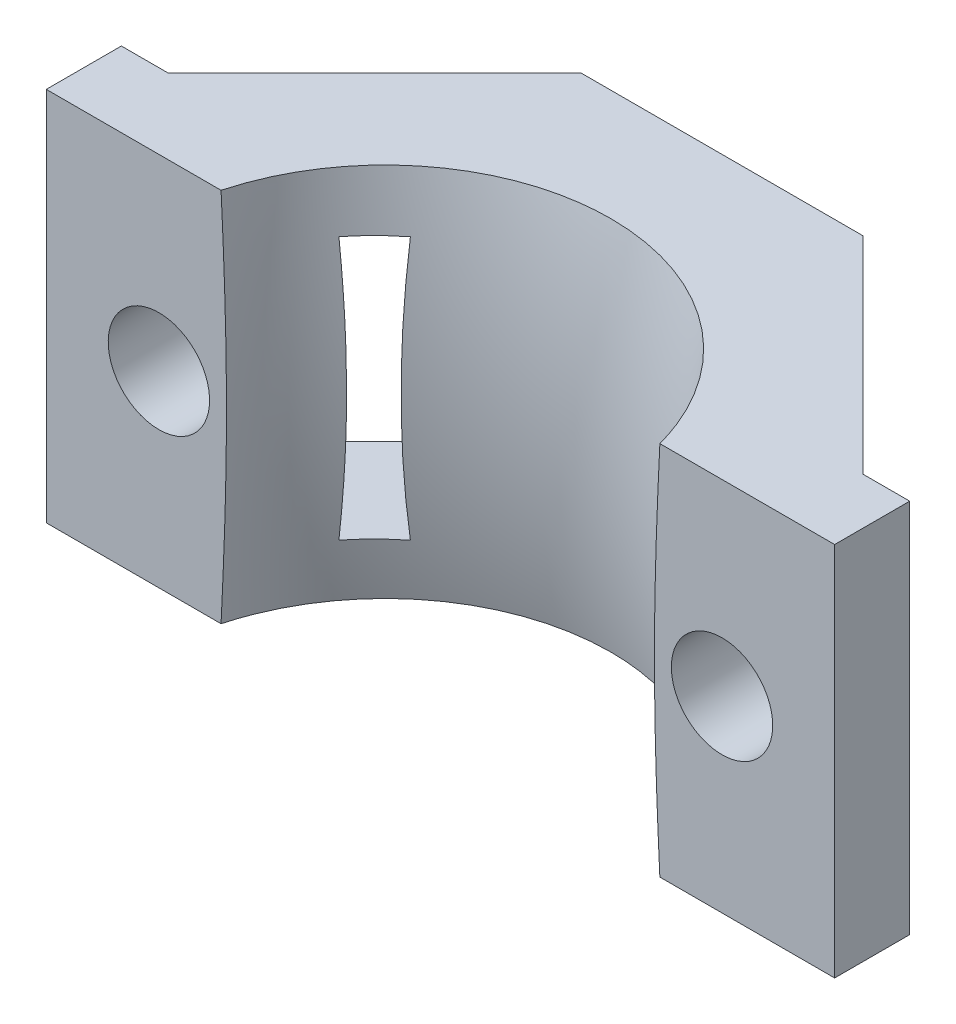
ISO-10303-21;
HEADER;
FILE_DESCRIPTION(('STEP AP214'),'2;1');
FILE_NAME('part.step','',(''),(''),'','','');
FILE_SCHEMA(('AUTOMOTIVE_DESIGN { 1 0 10303 214 1 1 1 1 }'));
ENDSEC;
DATA;
#1=APPLICATION_CONTEXT('core data for automotive mechanical design processes');
#2=APPLICATION_PROTOCOL_DEFINITION('international standard','automotive_design',2000,#1);
#3=PRODUCT_CONTEXT('',#1,'mechanical');
#4=PRODUCT('Part','Part','',(#3));
#5=PRODUCT_RELATED_PRODUCT_CATEGORY('part','',(#4));
#6=PRODUCT_DEFINITION_FORMATION('','',#4);
#7=PRODUCT_DEFINITION_CONTEXT('part definition',#1,'design');
#8=PRODUCT_DEFINITION('design','',#6,#7);
#9=PRODUCT_DEFINITION_SHAPE('','',#8);
#10=(LENGTH_UNIT() NAMED_UNIT(*) SI_UNIT(.MILLI.,.METRE.));
#11=(NAMED_UNIT(*) PLANE_ANGLE_UNIT() SI_UNIT($,.RADIAN.));
#12=(NAMED_UNIT(*) SI_UNIT($,.STERADIAN.) SOLID_ANGLE_UNIT());
#13=UNCERTAINTY_MEASURE_WITH_UNIT(LENGTH_MEASURE(1.E-05),#10,'distance_accuracy_value','');
#14=(GEOMETRIC_REPRESENTATION_CONTEXT(3) GLOBAL_UNCERTAINTY_ASSIGNED_CONTEXT((#13)) GLOBAL_UNIT_ASSIGNED_CONTEXT((#10,
#11,#12)) REPRESENTATION_CONTEXT('',''));
#15=CARTESIAN_POINT('',(0.,0.,0.));
#16=DIRECTION('',(0.,0.,1.));
#17=DIRECTION('',(1.,0.,0.));
#18=AXIS2_PLACEMENT_3D('',#15,#16,#17);
#19=CARTESIAN_POINT('',(15.,22.5,-82.));
#20=DIRECTION('',(0.,0.,1.));
#21=DIRECTION('',(1.,0.,0.));
#22=AXIS2_PLACEMENT_3D('',#19,#20,#21);
#23=CYLINDRICAL_SURFACE('',#22,2.7);
#24=CARTESIAN_POINT('',(15.,22.5,-82.));
#25=DIRECTION('',(0.,0.,1.));
#26=DIRECTION('',(1.,0.,0.));
#27=AXIS2_PLACEMENT_3D('',#24,#25,#26);
#28=CIRCLE('',#27,2.7);
#29=CARTESIAN_POINT('',(15.,25.2,-82.));
#30=VERTEX_POINT('',#29);
#31=EDGE_CURVE('E19',#30,#30,#28,.T.);
#32=ORIENTED_EDGE('',*,*,#31,.F.);
#33=EDGE_LOOP('',(#32));
#34=FACE_BOUND('',#33,.T.);
#35=CARTESIAN_POINT('',(15.,22.5,-78.));
#36=DIRECTION('',(0.,0.,1.));
#37=DIRECTION('',(1.,0.,0.));
#38=AXIS2_PLACEMENT_3D('',#35,#36,#37);
#39=CIRCLE('',#38,2.7);
#40=CARTESIAN_POINT('',(15.,25.2,-78.));
#41=VERTEX_POINT('',#40);
#42=EDGE_CURVE('E34',#41,#41,#39,.F.);
#43=ORIENTED_EDGE('',*,*,#42,.F.);
#44=EDGE_LOOP('',(#43));
#45=FACE_BOUND('',#44,.T.);
#46=ADVANCED_FACE('F16',(#34,#45),#23,.F.);
#47=CARTESIAN_POINT('',(18.5,32.5,-82.));
#48=DIRECTION('',(0.707106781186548,0.,-0.707106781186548));
#49=DIRECTION('',(-0.707106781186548,0.,-0.707106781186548));
#50=AXIS2_PLACEMENT_3D('',#47,#48,#49);
#51=PLANE('',#50);
#52=DIRECTION('',(0.707106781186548,0.,0.707106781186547));
#53=VECTOR('',#52,1.);
#54=CARTESIAN_POINT('',(7.5,12.5,-93.));
#55=LINE('',#54,#53);
#56=CARTESIAN_POINT('',(7.5,12.5,-93.));
#57=VERTEX_POINT('',#56);
#58=CARTESIAN_POINT('',(18.5,12.5,-82.));
#59=VERTEX_POINT('',#58);
#60=EDGE_CURVE('E292',#57,#59,#55,.T.);
#61=ORIENTED_EDGE('',*,*,#60,.F.);
#62=DIRECTION('',(0.,1.,0.));
#63=VECTOR('',#62,1.);
#64=CARTESIAN_POINT('',(7.5,32.5,-93.));
#65=LINE('',#64,#63);
#66=CARTESIAN_POINT('',(7.5,15.5,-93.));
#67=VERTEX_POINT('',#66);
#68=EDGE_CURVE('E192',#67,#57,#65,.F.);
#69=ORIENTED_EDGE('',*,*,#68,.F.);
#70=DIRECTION('',(-0.707106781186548,0.,-0.707106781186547));
#71=VECTOR('',#70,1.);
#72=CARTESIAN_POINT('',(18.5,15.5,-82.));
#73=LINE('',#72,#71);
#74=CARTESIAN_POINT('',(18.5,15.5,-82.));
#75=VERTEX_POINT('',#74);
#76=EDGE_CURVE('E315',#75,#67,#73,.T.);
#77=ORIENTED_EDGE('',*,*,#76,.F.);
#78=DIRECTION('',(0.,1.,0.));
#79=VECTOR('',#78,1.);
#80=CARTESIAN_POINT('',(18.5,32.5,-82.));
#81=LINE('',#80,#79);
#82=EDGE_CURVE('E262',#59,#75,#81,.T.);
#83=ORIENTED_EDGE('',*,*,#82,.F.);
#84=EDGE_LOOP('',(#61,#69,#77,#83));
#85=FACE_BOUND('',#84,.T.);
#86=ADVANCED_FACE('F537',(#85),#51,.T.);
#87=CARTESIAN_POINT('',(18.5,32.5,-82.));
#88=DIRECTION('',(0.707106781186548,0.,-0.707106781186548));
#89=DIRECTION('',(-0.707106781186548,0.,-0.707106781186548));
#90=AXIS2_PLACEMENT_3D('',#87,#88,#89);
#91=PLANE('',#90);
#92=DIRECTION('',(0.707106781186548,0.,0.707106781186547));
#93=VECTOR('',#92,1.);
#94=CARTESIAN_POINT('',(7.5,32.5,-93.));
#95=LINE('',#94,#93);
#96=CARTESIAN_POINT('',(7.5,32.5,-93.));
#97=VERTEX_POINT('',#96);
#98=CARTESIAN_POINT('',(18.5,32.5,-82.));
#99=VERTEX_POINT('',#98);
#100=EDGE_CURVE('E257',#97,#99,#95,.T.);
#101=ORIENTED_EDGE('',*,*,#100,.T.);
#102=DIRECTION('',(0.,1.,0.));
#103=VECTOR('',#102,1.);
#104=CARTESIAN_POINT('',(18.5,32.5,-82.));
#105=LINE('',#104,#103);
#106=CARTESIAN_POINT('',(18.5,29.5,-82.));
#107=VERTEX_POINT('',#106);
#108=EDGE_CURVE('E191',#107,#99,#105,.T.);
#109=ORIENTED_EDGE('',*,*,#108,.F.);
#110=DIRECTION('',(0.707106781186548,0.,0.707106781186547));
#111=VECTOR('',#110,1.);
#112=CARTESIAN_POINT('',(7.5,29.5,-93.));
#113=LINE('',#112,#111);
#114=CARTESIAN_POINT('',(7.5,29.5,-93.));
#115=VERTEX_POINT('',#114);
#116=EDGE_CURVE('E321',#115,#107,#113,.T.);
#117=ORIENTED_EDGE('',*,*,#116,.F.);
#118=DIRECTION('',(0.,1.,0.));
#119=VECTOR('',#118,1.);
#120=CARTESIAN_POINT('',(7.5,32.5,-93.));
#121=LINE('',#120,#119);
#122=EDGE_CURVE('E204',#97,#115,#121,.F.);
#123=ORIENTED_EDGE('',*,*,#122,.F.);
#124=EDGE_LOOP('',(#101,#109,#117,#123));
#125=FACE_BOUND('',#124,.T.);
#126=ADVANCED_FACE('F549',(#125),#91,.T.);
#127=CARTESIAN_POINT('',(21.,32.5,-78.));
#128=DIRECTION('',(1.,0.,0.));
#129=DIRECTION('',(0.,0.,-1.));
#130=AXIS2_PLACEMENT_3D('',#127,#128,#129);
#131=PLANE('',#130);
#132=DIRECTION('',(0.,0.,-1.));
#133=VECTOR('',#132,1.);
#134=CARTESIAN_POINT('',(21.,32.5,-83.5044583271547));
#135=LINE('',#134,#133);
#136=CARTESIAN_POINT('',(21.,32.5,-82.));
#137=VERTEX_POINT('',#136);
#138=CARTESIAN_POINT('',(21.,32.5,-78.));
#139=VERTEX_POINT('',#138);
#140=EDGE_CURVE('E249',#137,#139,#135,.F.);
#141=ORIENTED_EDGE('',*,*,#140,.T.);
#142=DIRECTION('',(0.,1.,0.));
#143=VECTOR('',#142,1.);
#144=CARTESIAN_POINT('',(21.,32.5,-78.));
#145=LINE('',#144,#143);
#146=CARTESIAN_POINT('',(21.,12.5,-78.));
#147=VERTEX_POINT('',#146);
#148=EDGE_CURVE('E244',#147,#139,#145,.T.);
#149=ORIENTED_EDGE('',*,*,#148,.F.);
#150=DIRECTION('',(0.,0.,-1.));
#151=VECTOR('',#150,1.);
#152=CARTESIAN_POINT('',(21.,12.5,-83.5044583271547));
#153=LINE('',#152,#151);
#154=CARTESIAN_POINT('',(21.,12.5,-82.));
#155=VERTEX_POINT('',#154);
#156=EDGE_CURVE('E285',#155,#147,#153,.F.);
#157=ORIENTED_EDGE('',*,*,#156,.F.);
#158=DIRECTION('',(0.,1.,0.));
#159=VECTOR('',#158,1.);
#160=CARTESIAN_POINT('',(21.,32.5,-82.));
#161=LINE('',#160,#159);
#162=EDGE_CURVE('E260',#137,#155,#161,.F.);
#163=ORIENTED_EDGE('',*,*,#162,.F.);
#164=EDGE_LOOP('',(#141,#149,#157,#163));
#165=FACE_BOUND('',#164,.T.);
#166=ADVANCED_FACE('F544',(#165),#131,.T.);
#167=CARTESIAN_POINT('',(-21.,32.5,-82.));
#168=DIRECTION('',(-1.,0.,0.));
#169=DIRECTION('',(0.,0.,1.));
#170=AXIS2_PLACEMENT_3D('',#167,#168,#169);
#171=PLANE('',#170);
#172=DIRECTION('',(0.,0.,-1.));
#173=VECTOR('',#172,1.);
#174=CARTESIAN_POINT('',(-21.,32.5,-83.5044583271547));
#175=LINE('',#174,#173);
#176=CARTESIAN_POINT('',(-21.,32.5,-78.));
#177=VERTEX_POINT('',#176);
#178=CARTESIAN_POINT('',(-21.,32.5,-82.));
#179=VERTEX_POINT('',#178);
#180=EDGE_CURVE('E220',#177,#179,#175,.T.);
#181=ORIENTED_EDGE('',*,*,#180,.T.);
#182=DIRECTION('',(0.,1.,0.));
#183=VECTOR('',#182,1.);
#184=CARTESIAN_POINT('',(-21.,32.5,-82.));
#185=LINE('',#184,#183);
#186=CARTESIAN_POINT('',(-21.,12.5,-82.));
#187=VERTEX_POINT('',#186);
#188=EDGE_CURVE('E214',#187,#179,#185,.T.);
#189=ORIENTED_EDGE('',*,*,#188,.F.);
#190=DIRECTION('',(0.,0.,-1.));
#191=VECTOR('',#190,1.);
#192=CARTESIAN_POINT('',(-21.,12.5,-83.5044583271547));
#193=LINE('',#192,#191);
#194=CARTESIAN_POINT('',(-21.,12.5,-78.));
#195=VERTEX_POINT('',#194);
#196=EDGE_CURVE('E235',#195,#187,#193,.T.);
#197=ORIENTED_EDGE('',*,*,#196,.F.);
#198=DIRECTION('',(0.,1.,0.));
#199=VECTOR('',#198,1.);
#200=CARTESIAN_POINT('',(-21.,32.5,-78.));
#201=LINE('',#200,#199);
#202=EDGE_CURVE('E279',#177,#195,#201,.F.);
#203=ORIENTED_EDGE('',*,*,#202,.F.);
#204=EDGE_LOOP('',(#181,#189,#197,#203));
#205=FACE_BOUND('',#204,.T.);
#206=ADVANCED_FACE('F526',(#205),#171,.T.);
#207=CARTESIAN_POINT('',(-15.,22.5,-82.));
#208=DIRECTION('',(0.,0.,1.));
#209=DIRECTION('',(1.,0.,0.));
#210=AXIS2_PLACEMENT_3D('',#207,#208,#209);
#211=CYLINDRICAL_SURFACE('',#210,2.7);
#212=CARTESIAN_POINT('',(-15.,22.5,-82.));
#213=DIRECTION('',(0.,0.,1.));
#214=DIRECTION('',(1.,0.,0.));
#215=AXIS2_PLACEMENT_3D('',#212,#213,#214);
#216=CIRCLE('',#215,2.7);
#217=CARTESIAN_POINT('',(-15.,19.8,-82.));
#218=VERTEX_POINT('',#217);
#219=EDGE_CURVE('E168',#218,#218,#216,.T.);
#220=ORIENTED_EDGE('',*,*,#219,.F.);
#221=EDGE_LOOP('',(#220));
#222=FACE_BOUND('',#221,.T.);
#223=CARTESIAN_POINT('',(-15.,22.5,-78.));
#224=DIRECTION('',(0.,0.,1.));
#225=DIRECTION('',(1.,0.,0.));
#226=AXIS2_PLACEMENT_3D('',#223,#224,#225);
#227=CIRCLE('',#226,2.7);
#228=CARTESIAN_POINT('',(-15.,19.8,-78.));
#229=VERTEX_POINT('',#228);
#230=EDGE_CURVE('E433',#229,#229,#227,.F.);
#231=ORIENTED_EDGE('',*,*,#230,.F.);
#232=EDGE_LOOP('',(#231));
#233=FACE_BOUND('',#232,.T.);
#234=ADVANCED_FACE('F566',(#222,#233),#211,.F.);
#235=CARTESIAN_POINT('',(-7.5,32.5,-93.));
#236=DIRECTION('',(-0.707106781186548,0.,-0.707106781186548));
#237=DIRECTION('',(-0.707106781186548,0.,0.707106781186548));
#238=AXIS2_PLACEMENT_3D('',#235,#236,#237);
#239=PLANE('',#238);
#240=DIRECTION('',(0.707106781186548,0.,-0.707106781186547));
#241=VECTOR('',#240,1.);
#242=CARTESIAN_POINT('',(-18.5,12.5,-82.));
#243=LINE('',#242,#241);
#244=CARTESIAN_POINT('',(-18.5,12.5,-82.));
#245=VERTEX_POINT('',#244);
#246=CARTESIAN_POINT('',(-7.5,12.5,-93.));
#247=VERTEX_POINT('',#246);
#248=EDGE_CURVE('E237',#245,#247,#243,.T.);
#249=ORIENTED_EDGE('',*,*,#248,.F.);
#250=DIRECTION('',(0.,1.,0.));
#251=VECTOR('',#250,1.);
#252=CARTESIAN_POINT('',(-18.5,32.5,-82.));
#253=LINE('',#252,#251);
#254=CARTESIAN_POINT('',(-18.5,15.5,-82.));
#255=VERTEX_POINT('',#254);
#256=EDGE_CURVE('E207',#255,#245,#253,.F.);
#257=ORIENTED_EDGE('',*,*,#256,.F.);
#258=DIRECTION('',(-0.707106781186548,0.,0.707106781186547));
#259=VECTOR('',#258,1.);
#260=CARTESIAN_POINT('',(-7.5,15.5,-93.));
#261=LINE('',#260,#259);
#262=CARTESIAN_POINT('',(-7.5,15.5,-93.));
#263=VERTEX_POINT('',#262);
#264=EDGE_CURVE('E197',#263,#255,#261,.T.);
#265=ORIENTED_EDGE('',*,*,#264,.F.);
#266=DIRECTION('',(0.,1.,0.));
#267=VECTOR('',#266,1.);
#268=CARTESIAN_POINT('',(-7.5,32.5,-93.));
#269=LINE('',#268,#267);
#270=EDGE_CURVE('E202',#247,#263,#269,.T.);
#271=ORIENTED_EDGE('',*,*,#270,.F.);
#272=EDGE_LOOP('',(#249,#257,#265,#271));
#273=FACE_BOUND('',#272,.T.);
#274=ADVANCED_FACE('F521',(#273),#239,.T.);
#275=CARTESIAN_POINT('',(7.5,32.5,-93.));
#276=DIRECTION('',(0.,0.,-1.));
#277=DIRECTION('',(-1.,0.,0.));
#278=AXIS2_PLACEMENT_3D('',#275,#276,#277);
#279=PLANE('',#278);
#280=DIRECTION('',(0.,1.,0.));
#281=VECTOR('',#280,1.);
#282=CARTESIAN_POINT('',(7.5,22.5,-93.));
#283=LINE('',#282,#281);
#284=EDGE_CURVE('E308',#67,#115,#283,.T.);
#285=ORIENTED_EDGE('',*,*,#284,.F.);
#286=ORIENTED_EDGE('',*,*,#68,.T.);
#287=DIRECTION('',(1.,0.,0.));
#288=VECTOR('',#287,1.);
#289=CARTESIAN_POINT('',(0.,12.5,-93.));
#290=LINE('',#289,#288);
#291=EDGE_CURVE('E241',#247,#57,#290,.T.);
#292=ORIENTED_EDGE('',*,*,#291,.F.);
#293=ORIENTED_EDGE('',*,*,#270,.T.);
#294=DIRECTION('',(0.,1.,0.));
#295=VECTOR('',#294,1.);
#296=CARTESIAN_POINT('',(-7.5,22.5,-93.));
#297=LINE('',#296,#295);
#298=CARTESIAN_POINT('',(-7.5,29.5,-93.));
#299=VERTEX_POINT('',#298);
#300=EDGE_CURVE('E463',#299,#263,#297,.F.);
#301=ORIENTED_EDGE('',*,*,#300,.F.);
#302=DIRECTION('',(0.,1.,0.));
#303=VECTOR('',#302,1.);
#304=CARTESIAN_POINT('',(-7.5,32.5,-93.));
#305=LINE('',#304,#303);
#306=CARTESIAN_POINT('',(-7.5,32.5,-93.));
#307=VERTEX_POINT('',#306);
#308=EDGE_CURVE('E179',#307,#299,#305,.F.);
#309=ORIENTED_EDGE('',*,*,#308,.F.);
#310=DIRECTION('',(1.,0.,0.));
#311=VECTOR('',#310,1.);
#312=CARTESIAN_POINT('',(0.,32.5,-93.));
#313=LINE('',#312,#311);
#314=EDGE_CURVE('E219',#307,#97,#313,.T.);
#315=ORIENTED_EDGE('',*,*,#314,.T.);
#316=ORIENTED_EDGE('',*,*,#122,.T.);
#317=EDGE_LOOP('',(#285,#286,#292,#293,#301,#309,#315,#316));
#318=FACE_BOUND('',#317,.T.);
#319=ADVANCED_FACE('F532',(#318),#279,.T.);
#320=CARTESIAN_POINT('',(-7.5,32.5,-93.));
#321=DIRECTION('',(-0.707106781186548,0.,-0.707106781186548));
#322=DIRECTION('',(-0.707106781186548,0.,0.707106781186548));
#323=AXIS2_PLACEMENT_3D('',#320,#321,#322);
#324=PLANE('',#323);
#325=DIRECTION('',(0.707106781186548,0.,-0.707106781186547));
#326=VECTOR('',#325,1.);
#327=CARTESIAN_POINT('',(-18.5,32.5,-82.));
#328=LINE('',#327,#326);
#329=CARTESIAN_POINT('',(-18.5,32.5,-82.));
#330=VERTEX_POINT('',#329);
#331=EDGE_CURVE('E217',#330,#307,#328,.T.);
#332=ORIENTED_EDGE('',*,*,#331,.T.);
#333=ORIENTED_EDGE('',*,*,#308,.T.);
#334=DIRECTION('',(0.707106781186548,0.,-0.707106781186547));
#335=VECTOR('',#334,1.);
#336=CARTESIAN_POINT('',(-18.5,29.5,-82.));
#337=LINE('',#336,#335);
#338=CARTESIAN_POINT('',(-18.5,29.5,-82.));
#339=VERTEX_POINT('',#338);
#340=EDGE_CURVE('E173',#339,#299,#337,.T.);
#341=ORIENTED_EDGE('',*,*,#340,.F.);
#342=DIRECTION('',(0.,1.,0.));
#343=VECTOR('',#342,1.);
#344=CARTESIAN_POINT('',(-18.5,32.5,-82.));
#345=LINE('',#344,#343);
#346=EDGE_CURVE('E158',#330,#339,#345,.F.);
#347=ORIENTED_EDGE('',*,*,#346,.F.);
#348=EDGE_LOOP('',(#332,#333,#341,#347));
#349=FACE_BOUND('',#348,.T.);
#350=ADVANCED_FACE('F178',(#349),#324,.T.);
#351=CARTESIAN_POINT('',(21.,32.5,-82.));
#352=DIRECTION('',(0.,0.,-1.));
#353=DIRECTION('',(-1.,0.,0.));
#354=AXIS2_PLACEMENT_3D('',#351,#352,#353);
#355=PLANE('',#354);
#356=ORIENTED_EDGE('',*,*,#31,.T.);
#357=EDGE_LOOP('',(#356));
#358=FACE_BOUND('',#357,.T.);
#359=ORIENTED_EDGE('',*,*,#82,.T.);
#360=DIRECTION('',(1.,0.,0.));
#361=VECTOR('',#360,1.);
#362=CARTESIAN_POINT('',(13.,15.5,-82.));
#363=LINE('',#362,#361);
#364=CARTESIAN_POINT('',(9.40963978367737,15.5,-82.));
#365=VERTEX_POINT('',#364);
#366=EDGE_CURVE('E318',#365,#75,#363,.T.);
#367=ORIENTED_EDGE('',*,*,#366,.F.);
#368=CARTESIAN_POINT('',(9.40963978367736,15.5,-82.));
#369=CARTESIAN_POINT('',(9.3666740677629,15.8886748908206,-82.));
#370=CARTESIAN_POINT('',(9.32647367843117,16.277666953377,-82.));
#371=CARTESIAN_POINT('',(9.25233016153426,17.0555736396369,-82.));
#372=CARTESIAN_POINT('',(9.21837644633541,17.4444872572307,-82.));
#373=CARTESIAN_POINT('',(9.15734649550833,18.2222802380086,-82.));
#374=CARTESIAN_POINT('',(9.13026016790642,18.6111588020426,-82.));
#375=CARTESIAN_POINT('',(9.0834571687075,19.3889072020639,-82.));
#376=CARTESIAN_POINT('',(9.0637319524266,19.7777765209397,-82.));
#377=CARTESIAN_POINT('',(9.03202293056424,20.5555269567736,-82.));
#378=CARTESIAN_POINT('',(9.02003305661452,20.9444078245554,-82.));
#379=CARTESIAN_POINT('',(9.00402304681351,21.7221925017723,-82.));
#380=CARTESIAN_POINT('',(8.99999999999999,22.1110962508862,-82.));
#381=CARTESIAN_POINT('',(8.99999999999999,22.8889037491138,-82.));
#382=CARTESIAN_POINT('',(9.00402304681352,23.2778074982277,-82.));
#383=CARTESIAN_POINT('',(9.02003305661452,24.0555921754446,-82.));
#384=CARTESIAN_POINT('',(9.03202293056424,24.4444730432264,-82.));
#385=CARTESIAN_POINT('',(9.06373195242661,25.2222234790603,-82.));
#386=CARTESIAN_POINT('',(9.08345716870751,25.6110927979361,-82.));
#387=CARTESIAN_POINT('',(9.13026016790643,26.3888411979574,-82.));
#388=CARTESIAN_POINT('',(9.15734649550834,26.7777197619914,-82.));
#389=CARTESIAN_POINT('',(9.2183764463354,27.5555127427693,-82.));
#390=CARTESIAN_POINT('',(9.25233016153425,27.9444263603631,-82.));
#391=CARTESIAN_POINT('',(9.32647367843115,28.722333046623,-82.));
#392=CARTESIAN_POINT('',(9.36667406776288,29.1113251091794,-82.));
#393=CARTESIAN_POINT('',(9.40963978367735,29.5,-82.));
#394=B_SPLINE_CURVE_WITH_KNOTS('',3,(#368,#369,#370,#371,#372,#373,#374,#375,#376,#377,#378,
#379,#380,#381,#382,#383,#384,#385,#386,#387,#388,#389,#390,#391,#392,#393),.UNSPECIFIED.,.F.,
.F.,(4,2,2,2,2,2,2,2,2,2,2,2,4),(0.,1.17313460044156,2.34426213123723,3.51365852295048,
4.68169324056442,5.8488105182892,7.01550126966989,8.18219202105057,9.34930929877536,
10.5173440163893,11.6867404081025,12.8578679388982,14.0310025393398),.UNSPECIFIED.);
#395=CARTESIAN_POINT('',(9.40963978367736,29.5,-82.));
#396=VERTEX_POINT('',#395);
#397=EDGE_CURVE('E182',#365,#396,#394,.T.);
#398=ORIENTED_EDGE('',*,*,#397,.T.);
#399=DIRECTION('',(1.,0.,0.));
#400=VECTOR('',#399,1.);
#401=CARTESIAN_POINT('',(13.,29.5,-82.));
#402=LINE('',#401,#400);
#403=EDGE_CURVE('E312',#107,#396,#402,.F.);
#404=ORIENTED_EDGE('',*,*,#403,.F.);
#405=ORIENTED_EDGE('',*,*,#108,.T.);
#406=DIRECTION('',(1.,0.,0.));
#407=VECTOR('',#406,1.);
#408=CARTESIAN_POINT('',(0.,32.5,-82.));
#409=LINE('',#408,#407);
#410=EDGE_CURVE('E252',#99,#137,#409,.T.);
#411=ORIENTED_EDGE('',*,*,#410,.T.);
#412=ORIENTED_EDGE('',*,*,#162,.T.);
#413=DIRECTION('',(1.,0.,0.));
#414=VECTOR('',#413,1.);
#415=CARTESIAN_POINT('',(0.,12.5,-82.));
#416=LINE('',#415,#414);
#417=EDGE_CURVE('E287',#59,#155,#416,.T.);
#418=ORIENTED_EDGE('',*,*,#417,.F.);
#419=EDGE_LOOP('',(#359,#367,#398,#404,#405,#411,#412,#418));
#420=FACE_BOUND('',#419,.T.);
#421=ADVANCED_FACE('F417',(#358,#420),#355,.T.);
#422=CARTESIAN_POINT('',(13.,29.5,-87.5));
#423=DIRECTION('',(0.,-1.,0.));
#424=DIRECTION('',(0.,0.,-1.));
#425=AXIS2_PLACEMENT_3D('',#422,#423,#424);
#426=PLANE('',#425);
#427=ORIENTED_EDGE('',*,*,#116,.T.);
#428=ORIENTED_EDGE('',*,*,#403,.T.);
#429=CARTESIAN_POINT('',(9.40963978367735,29.5,-82.));
#430=CARTESIAN_POINT('',(9.3389451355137,29.5,-82.0878077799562));
#431=CARTESIAN_POINT('',(9.26703659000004,29.5,-82.1746382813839));
#432=CARTESIAN_POINT('',(9.12101331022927,29.5,-82.3460821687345));
#433=CARTESIAN_POINT('',(9.04690398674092,29.5,-82.4307001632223));
#434=CARTESIAN_POINT('',(8.89649217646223,29.5,-82.5977306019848));
#435=CARTESIAN_POINT('',(8.82019320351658,29.5,-82.6801462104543));
#436=CARTESIAN_POINT('',(8.66541017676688,29.5,-82.8427790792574));
#437=CARTESIAN_POINT('',(8.58692784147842,29.5,-82.9229979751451));
#438=CARTESIAN_POINT('',(8.42777980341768,29.5,-83.0812406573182));
#439=CARTESIAN_POINT('',(8.34711409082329,29.5,-83.1592644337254));
#440=CARTESIAN_POINT('',(8.18359703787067,29.5,-83.313114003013));
#441=CARTESIAN_POINT('',(8.10074407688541,29.5,-83.3889380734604));
#442=CARTESIAN_POINT('',(7.93284517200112,29.5,-83.5383801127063));
#443=CARTESIAN_POINT('',(7.84779607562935,29.5,-83.6119945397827));
#444=CARTESIAN_POINT('',(7.6754930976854,29.5,-83.7570043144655));
#445=CARTESIAN_POINT('',(7.58823460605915,29.5,-83.8283941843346));
#446=CARTESIAN_POINT('',(7.50000000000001,29.5,-83.8985567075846));
#447=B_SPLINE_CURVE_WITH_KNOTS('',3,(#429,#430,#431,#432,#433,#434,#435,#436,#437,#438,#439,
#440,#441,#442,#443,#444,#445,#446),.UNSPECIFIED.,.F.,.F.,(4,2,2,2,2,2,2,2,4),(0.,
0.338177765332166,0.675583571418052,1.01247526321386,1.34910889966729,1.68574405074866,
2.02263604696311,2.36004195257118,2.69822183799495),.UNSPECIFIED.);
#448=CARTESIAN_POINT('',(7.5,29.5,-83.8985567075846));
#449=VERTEX_POINT('',#448);
#450=EDGE_CURVE('E421',#396,#449,#447,.T.);
#451=ORIENTED_EDGE('',*,*,#450,.T.);
#452=DIRECTION('',(0.,0.,-1.));
#453=VECTOR('',#452,1.);
#454=CARTESIAN_POINT('',(7.5,29.5,-87.5));
#455=LINE('',#454,#453);
#456=EDGE_CURVE('E311',#115,#449,#455,.F.);
#457=ORIENTED_EDGE('',*,*,#456,.F.);
#458=EDGE_LOOP('',(#427,#428,#451,#457));
#459=FACE_BOUND('',#458,.T.);
#460=ADVANCED_FACE('F412',(#459),#426,.T.);
#461=CARTESIAN_POINT('',(7.5,22.5,-87.5));
#462=DIRECTION('',(1.,0.,0.));
#463=DIRECTION('',(0.,0.,-1.));
#464=AXIS2_PLACEMENT_3D('',#461,#462,#463);
#465=PLANE('',#464);
#466=ORIENTED_EDGE('',*,*,#284,.T.);
#467=ORIENTED_EDGE('',*,*,#456,.T.);
#468=CARTESIAN_POINT('',(7.5,22.5,-133.));
#469=DIRECTION('',(1.,0.,0.));
#470=DIRECTION('',(0.,0.,-1.));
#471=AXIS2_PLACEMENT_3D('',#468,#469,#470);
#472=CIRCLE('',#471,49.5979004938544);
#473=CARTESIAN_POINT('',(7.50000000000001,15.5,-83.8985567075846));
#474=VERTEX_POINT('',#473);
#475=EDGE_CURVE('E400',#449,#474,#472,.T.);
#476=ORIENTED_EDGE('',*,*,#475,.T.);
#477=DIRECTION('',(0.,0.,1.));
#478=VECTOR('',#477,1.);
#479=CARTESIAN_POINT('',(7.5,15.5,-87.5));
#480=LINE('',#479,#478);
#481=EDGE_CURVE('E246',#67,#474,#480,.T.);
#482=ORIENTED_EDGE('',*,*,#481,.F.);
#483=EDGE_LOOP('',(#466,#467,#476,#482));
#484=FACE_BOUND('',#483,.T.);
#485=ADVANCED_FACE('F407',(#484),#465,.T.);
#486=CARTESIAN_POINT('',(13.,15.5,-87.5));
#487=DIRECTION('',(0.,1.,0.));
#488=DIRECTION('',(0.,0.,1.));
#489=AXIS2_PLACEMENT_3D('',#486,#487,#488);
#490=PLANE('',#489);
#491=ORIENTED_EDGE('',*,*,#76,.T.);
#492=ORIENTED_EDGE('',*,*,#481,.T.);
#493=CARTESIAN_POINT('',(7.50000000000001,15.5,-83.8985567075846));
#494=CARTESIAN_POINT('',(7.58823460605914,15.5,-83.8283941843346));
#495=CARTESIAN_POINT('',(7.6754930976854,15.5,-83.7570043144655));
#496=CARTESIAN_POINT('',(7.84779607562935,15.5,-83.6119945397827));
#497=CARTESIAN_POINT('',(7.93284517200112,15.5,-83.5383801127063));
#498=CARTESIAN_POINT('',(8.10074407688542,15.5,-83.3889380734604));
#499=CARTESIAN_POINT('',(8.18359703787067,15.5,-83.313114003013));
#500=CARTESIAN_POINT('',(8.34711409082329,15.5,-83.1592644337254));
#501=CARTESIAN_POINT('',(8.42777980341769,15.5,-83.0812406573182));
#502=CARTESIAN_POINT('',(8.58692784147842,15.5,-82.9229979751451));
#503=CARTESIAN_POINT('',(8.66541017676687,15.5,-82.8427790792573));
#504=CARTESIAN_POINT('',(8.82019320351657,15.5,-82.6801462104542));
#505=CARTESIAN_POINT('',(8.89649217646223,15.5,-82.5977306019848));
#506=CARTESIAN_POINT('',(9.04690398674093,15.5,-82.4307001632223));
#507=CARTESIAN_POINT('',(9.12101331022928,15.5,-82.3460821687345));
#508=CARTESIAN_POINT('',(9.26703659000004,15.5,-82.1746382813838));
#509=CARTESIAN_POINT('',(9.3389451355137,15.5,-82.0878077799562));
#510=CARTESIAN_POINT('',(9.40963978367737,15.5,-82.));
#511=B_SPLINE_CURVE_WITH_KNOTS('',3,(#493,#494,#495,#496,#497,#498,#499,#500,#501,#502,#503,
#504,#505,#506,#507,#508,#509,#510),.UNSPECIFIED.,.F.,.F.,(4,2,2,2,2,2,2,2,4),(0.,
0.338179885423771,0.675585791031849,1.0124777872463,1.34911293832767,1.6857465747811,
2.02263826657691,2.3600440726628,2.69822183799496),.UNSPECIFIED.);
#512=EDGE_CURVE('E388',#474,#365,#511,.T.);
#513=ORIENTED_EDGE('',*,*,#512,.T.);
#514=ORIENTED_EDGE('',*,*,#366,.T.);
#515=EDGE_LOOP('',(#491,#492,#513,#514));
#516=FACE_BOUND('',#515,.T.);
#517=ADVANCED_FACE('F402',(#516),#490,.T.);
#518=CARTESIAN_POINT('',(0.,32.5,-78.));
#519=DIRECTION('',(0.,0.,1.));
#520=DIRECTION('',(1.,0.,0.));
#521=AXIS2_PLACEMENT_3D('',#518,#519,#520);
#522=PLANE('',#521);
#523=ORIENTED_EDGE('',*,*,#42,.T.);
#524=EDGE_LOOP('',(#523));
#525=FACE_BOUND('',#524,.T.);
#526=ORIENTED_EDGE('',*,*,#148,.T.);
#527=DIRECTION('',(1.,0.,0.));
#528=VECTOR('',#527,1.);
#529=CARTESIAN_POINT('',(0.,32.5,-78.));
#530=LINE('',#529,#528);
#531=CARTESIAN_POINT('',(11.6887107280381,32.5,-78.));
#532=VERTEX_POINT('',#531);
#533=EDGE_CURVE('E210',#139,#532,#530,.F.);
#534=ORIENTED_EDGE('',*,*,#533,.T.);
#535=CARTESIAN_POINT('',(11.6887107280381,32.5,-78.));
#536=CARTESIAN_POINT('',(11.6612731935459,31.9444175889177,-78.));
#537=CARTESIAN_POINT('',(11.6347396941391,31.3887842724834,-78.));
#538=CARTESIAN_POINT('',(11.5846124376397,30.2775857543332,-78.));
#539=CARTESIAN_POINT('',(11.561017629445,29.7220205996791,-78.));
#540=CARTESIAN_POINT('',(11.5178855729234,28.6109214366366,-78.));
#541=CARTESIAN_POINT('',(11.4983469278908,28.055387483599,-78.));
#542=CARTESIAN_POINT('',(11.4641965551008,26.9443274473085,-78.));
#543=CARTESIAN_POINT('',(11.4495833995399,26.3888014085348,-78.));
#544=CARTESIAN_POINT('',(11.4259366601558,25.2777393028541,-78.));
#545=CARTESIAN_POINT('',(11.4169019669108,24.7222032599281,-78.));
#546=CARTESIAN_POINT('',(11.4048110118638,23.6111114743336,-78.));
#547=CARTESIAN_POINT('',(11.4017542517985,23.0555557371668,-78.));
#548=CARTESIAN_POINT('',(11.4017542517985,21.9444442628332,-78.));
#549=CARTESIAN_POINT('',(11.4048110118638,21.3888885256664,-78.));
#550=CARTESIAN_POINT('',(11.4169019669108,20.2777967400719,-78.));
#551=CARTESIAN_POINT('',(11.4259366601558,19.7222606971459,-78.));
#552=CARTESIAN_POINT('',(11.4495833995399,18.6111985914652,-78.));
#553=CARTESIAN_POINT('',(11.4641965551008,18.0556725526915,-78.));
#554=CARTESIAN_POINT('',(11.4983469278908,16.9446125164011,-78.));
#555=CARTESIAN_POINT('',(11.5178855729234,16.3890785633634,-78.));
#556=CARTESIAN_POINT('',(11.561017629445,15.2779794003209,-78.));
#557=CARTESIAN_POINT('',(11.5846124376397,14.7224142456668,-78.));
#558=CARTESIAN_POINT('',(11.6347396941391,13.6112157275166,-78.));
#559=CARTESIAN_POINT('',(11.6612731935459,13.0555824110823,-78.));
#560=CARTESIAN_POINT('',(11.6887107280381,12.5,-78.));
#561=B_SPLINE_CURVE_WITH_KNOTS('',3,(#535,#536,#537,#538,#539,#540,#541,#542,#543,#544,#545,
#546,#547,#548,#549,#550,#551,#552,#553,#554,#555,#556,#557,#558,#559,#560),.UNSPECIFIED.,.F.,
.F.,(4,2,2,2,2,2,2,2,2,2,2,2,4),(0.,1.66878747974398,3.33697634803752,5.00458983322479,
6.67171949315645,8.3385174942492,10.005176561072,11.6718356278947,13.3386336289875,
15.0057632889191,16.6733767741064,18.3415656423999,20.0103531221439),.UNSPECIFIED.);
#562=CARTESIAN_POINT('',(11.6887107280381,12.5,-78.));
#563=VERTEX_POINT('',#562);
#564=EDGE_CURVE('E387',#532,#563,#561,.T.);
#565=ORIENTED_EDGE('',*,*,#564,.T.);
#566=DIRECTION('',(1.,0.,0.));
#567=VECTOR('',#566,1.);
#568=CARTESIAN_POINT('',(0.,12.5,-78.));
#569=LINE('',#568,#567);
#570=EDGE_CURVE('E282',#147,#563,#569,.F.);
#571=ORIENTED_EDGE('',*,*,#570,.F.);
#572=EDGE_LOOP('',(#526,#534,#565,#571));
#573=FACE_BOUND('',#572,.T.);
#574=ADVANCED_FACE('F406',(#525,#573),#522,.T.);
#575=CARTESIAN_POINT('',(0.,12.5,-83.5044583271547));
#576=DIRECTION('',(0.,-1.,0.));
#577=DIRECTION('',(0.,0.,-1.));
#578=AXIS2_PLACEMENT_3D('',#575,#576,#577);
#579=PLANE('',#578);
#580=ORIENTED_EDGE('',*,*,#156,.T.);
#581=ORIENTED_EDGE('',*,*,#570,.T.);
#582=CARTESIAN_POINT('',(11.6887107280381,12.5,-78.));
#583=CARTESIAN_POINT('',(11.5972593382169,12.5,-78.3371941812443));
#584=CARTESIAN_POINT('',(11.4916158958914,12.5,-78.6705360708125));
#585=CARTESIAN_POINT('',(11.2528005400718,12.5,-79.3272089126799));
#586=CARTESIAN_POINT('',(11.1196286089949,12.5,-79.6505398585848));
#587=CARTESIAN_POINT('',(10.8265851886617,12.5,-80.2849421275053));
#588=CARTESIAN_POINT('',(10.6667088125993,12.5,-80.5960111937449));
#589=CARTESIAN_POINT('',(10.3213534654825,12.5,-81.203589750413));
#590=CARTESIAN_POINT('',(10.1358750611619,12.5,-81.5000995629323));
#591=CARTESIAN_POINT('',(9.74041776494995,12.5,-82.0765953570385));
#592=CARTESIAN_POINT('',(9.53042284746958,12.5,-82.3565703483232));
#593=CARTESIAN_POINT('',(9.08744541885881,12.5,-82.8977011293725));
#594=CARTESIAN_POINT('',(8.85446321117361,12.5,-83.1588571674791));
#595=CARTESIAN_POINT('',(8.36719574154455,12.5,-83.6602638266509));
#596=CARTESIAN_POINT('',(8.11291962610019,12.5,-83.9005233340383));
#597=CARTESIAN_POINT('',(7.58473412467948,12.5,-84.3583900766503));
#598=CARTESIAN_POINT('',(7.31082520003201,12.5,-84.5759978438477));
#599=CARTESIAN_POINT('',(6.74822812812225,12.5,-84.9846967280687));
#600=CARTESIAN_POINT('',(6.45972292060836,12.5,-85.1760396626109));
#601=CARTESIAN_POINT('',(5.86736796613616,12.5,-85.5333186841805));
#602=CARTESIAN_POINT('',(5.56351775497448,12.5,-85.6992540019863));
#603=CARTESIAN_POINT('',(4.94268224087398,12.5,-86.0043295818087));
#604=CARTESIAN_POINT('',(4.62569799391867,12.5,-86.1434719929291));
#605=CARTESIAN_POINT('',(3.98090132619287,12.5,-86.3937908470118));
#606=CARTESIAN_POINT('',(3.65309047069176,12.5,-86.5049713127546));
#607=CARTESIAN_POINT('',(3.05170151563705,12.5,-86.6801808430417));
#608=CARTESIAN_POINT('',(2.77954978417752,12.5,-86.7491475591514));
#609=CARTESIAN_POINT('',(2.23107811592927,12.5,-86.867656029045));
#610=CARTESIAN_POINT('',(1.95475880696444,12.5,-86.9172006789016));
#611=CARTESIAN_POINT('',(1.39943192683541,12.5,-86.9965598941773));
#612=CARTESIAN_POINT('',(1.12042563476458,12.5,-87.026383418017));
#613=CARTESIAN_POINT('',(0.560948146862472,12.5,-87.0661906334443));
#614=CARTESIAN_POINT('',(0.28047668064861,12.5,-87.0761705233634));
#615=CARTESIAN_POINT('',(0.,12.5,-87.0761499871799));
#616=B_SPLINE_CURVE_WITH_KNOTS('',3,(#582,#583,#584,#585,#586,#587,#588,#589,#590,#591,#592,
#593,#594,#595,#596,#597,#598,#599,#600,#601,#602,#603,#604,#605,#606,#607,#608,#609,#610,#611,
#612,#613,#614,#615),.UNSPECIFIED.,.F.,.F.,(4,2,2,2,2,2,2,2,2,2,2,2,2,2,2,2,4),(0.,
1.04781671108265,2.0956340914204,3.14364342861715,4.19162957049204,5.24030462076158,
6.28896582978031,7.33717888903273,8.38536732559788,9.42267457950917,10.4600132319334,
11.4972686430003,12.5343747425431,13.3759656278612,14.2174309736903,15.0585138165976,
15.8997577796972),.UNSPECIFIED.);
#617=CARTESIAN_POINT('',(0.,12.5,-87.0761499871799));
#618=VERTEX_POINT('',#617);
#619=EDGE_CURVE('E490',#563,#618,#616,.T.);
#620=ORIENTED_EDGE('',*,*,#619,.T.);
#621=CARTESIAN_POINT('',(0.,12.5,-87.0761499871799));
#622=CARTESIAN_POINT('',(-0.335736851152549,12.5,-87.0761928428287));
#623=CARTESIAN_POINT('',(-0.671464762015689,12.5,-87.0618804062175));
#624=CARTESIAN_POINT('',(-1.34046653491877,12.5,-87.0048569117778));
#625=CARTESIAN_POINT('',(-1.67374064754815,12.5,-86.9621487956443));
#626=CARTESIAN_POINT('',(-2.3350692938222,12.5,-86.8487143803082));
#627=CARTESIAN_POINT('',(-2.66312964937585,12.5,-86.7780220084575));
#628=CARTESIAN_POINT('',(-3.31211515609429,12.5,-86.6092183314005));
#629=CARTESIAN_POINT('',(-3.63304031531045,12.5,-86.5111070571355));
#630=CARTESIAN_POINT('',(-4.26554876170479,12.5,-86.2882483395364));
#631=CARTESIAN_POINT('',(-4.57713082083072,12.5,-86.1634974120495));
#632=CARTESIAN_POINT('',(-5.18876675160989,12.5,-85.8883644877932));
#633=CARTESIAN_POINT('',(-5.48882044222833,12.5,-85.7379820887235));
#634=CARTESIAN_POINT('',(-6.07532287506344,12.5,-85.4127867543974));
#635=CARTESIAN_POINT('',(-6.36177355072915,12.5,-85.2379773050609));
#636=CARTESIAN_POINT('',(-6.91921490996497,12.5,-84.8652459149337));
#637=CARTESIAN_POINT('',(-7.19020558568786,12.5,-84.6673239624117));
#638=CARTESIAN_POINT('',(-7.71794420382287,12.5,-84.2474671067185));
#639=CARTESIAN_POINT('',(-7.97449562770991,12.5,-84.025285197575));
#640=CARTESIAN_POINT('',(-8.46831061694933,12.5,-83.5604262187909));
#641=CARTESIAN_POINT('',(-8.70557369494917,12.5,-83.317748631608));
#642=CARTESIAN_POINT('',(-9.159357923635,12.5,-82.8135705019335));
#643=CARTESIAN_POINT('',(-9.37587174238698,12.5,-82.5520633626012));
#644=CARTESIAN_POINT('',(-9.78668595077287,12.5,-82.0121500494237));
#645=CARTESIAN_POINT('',(-9.9809866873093,12.5,-81.7337441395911));
#646=CARTESIAN_POINT('',(-10.3333857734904,12.5,-81.1819564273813));
#647=CARTESIAN_POINT('',(-10.4930648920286,12.5,-80.9095821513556));
#648=CARTESIAN_POINT('',(-10.7912786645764,12.5,-80.3535049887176));
#649=CARTESIAN_POINT('',(-10.9298142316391,12.5,-80.0698025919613));
#650=CARTESIAN_POINT('',(-11.1848927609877,12.5,-79.4929253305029));
#651=CARTESIAN_POINT('',(-11.3014515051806,12.5,-79.1997574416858));
#652=CARTESIAN_POINT('',(-11.5120937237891,12.5,-78.6054382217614));
#653=CARTESIAN_POINT('',(-11.606176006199,12.5,-78.3042864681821));
#654=CARTESIAN_POINT('',(-11.6887107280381,12.5,-78.));
#655=B_SPLINE_CURVE_WITH_KNOTS('',3,(#621,#622,#623,#624,#625,#626,#627,#628,#629,#630,#631,
#632,#633,#634,#635,#636,#637,#638,#639,#640,#641,#642,#643,#644,#645,#646,#647,#648,#649,#650,
#651,#652,#653,#654),.UNSPECIFIED.,.F.,.F.,(4,2,2,2,2,2,2,2,2,2,2,2,2,2,2,2,4),(0.,
1.00689230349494,2.01368031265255,3.01925143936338,4.02482143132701,5.03052302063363,
6.03624039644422,7.04181439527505,8.04738890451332,9.06437440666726,10.0813855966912,
11.0987548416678,12.1161081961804,13.062396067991,14.0086430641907,14.9542079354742,
15.8998229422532),.UNSPECIFIED.);
#656=CARTESIAN_POINT('',(-11.6887107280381,12.5,-78.));
#657=VERTEX_POINT('',#656);
#658=EDGE_CURVE('E493',#618,#657,#655,.T.);
#659=ORIENTED_EDGE('',*,*,#658,.T.);
#660=DIRECTION('',(1.,0.,0.));
#661=VECTOR('',#660,1.);
#662=CARTESIAN_POINT('',(0.,12.5,-78.));
#663=LINE('',#662,#661);
#664=EDGE_CURVE('E281',#195,#657,#663,.T.);
#665=ORIENTED_EDGE('',*,*,#664,.F.);
#666=ORIENTED_EDGE('',*,*,#196,.T.);
#667=DIRECTION('',(-1.,0.,0.));
#668=VECTOR('',#667,1.);
#669=CARTESIAN_POINT('',(-18.5,12.5,-82.));
#670=LINE('',#669,#668);
#671=EDGE_CURVE('E209',#245,#187,#670,.T.);
#672=ORIENTED_EDGE('',*,*,#671,.F.);
#673=ORIENTED_EDGE('',*,*,#248,.T.);
#674=ORIENTED_EDGE('',*,*,#291,.T.);
#675=ORIENTED_EDGE('',*,*,#60,.T.);
#676=ORIENTED_EDGE('',*,*,#417,.T.);
#677=EDGE_LOOP('',(#580,#581,#620,#659,#665,#666,#672,#673,#674,#675,#676));
#678=FACE_BOUND('',#677,.T.);
#679=ADVANCED_FACE('F501',(#678),#579,.T.);
#680=CARTESIAN_POINT('',(0.,32.5,-78.));
#681=DIRECTION('',(0.,0.,1.));
#682=DIRECTION('',(1.,0.,0.));
#683=AXIS2_PLACEMENT_3D('',#680,#681,#682);
#684=PLANE('',#683);
#685=ORIENTED_EDGE('',*,*,#230,.T.);
#686=EDGE_LOOP('',(#685));
#687=FACE_BOUND('',#686,.T.);
#688=ORIENTED_EDGE('',*,*,#202,.T.);
#689=ORIENTED_EDGE('',*,*,#664,.T.);
#690=CARTESIAN_POINT('',(-11.6887107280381,12.5,-78.));
#691=CARTESIAN_POINT('',(-11.6612731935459,13.0555824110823,-78.));
#692=CARTESIAN_POINT('',(-11.6347396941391,13.6112157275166,-78.));
#693=CARTESIAN_POINT('',(-11.5846124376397,14.7224142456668,-78.));
#694=CARTESIAN_POINT('',(-11.561017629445,15.2779794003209,-78.));
#695=CARTESIAN_POINT('',(-11.5178855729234,16.3890785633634,-78.));
#696=CARTESIAN_POINT('',(-11.4983469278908,16.944612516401,-78.));
#697=CARTESIAN_POINT('',(-11.4641965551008,18.0556725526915,-78.));
#698=CARTESIAN_POINT('',(-11.4495833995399,18.6111985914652,-78.));
#699=CARTESIAN_POINT('',(-11.4259366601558,19.7222606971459,-78.));
#700=CARTESIAN_POINT('',(-11.4169019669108,20.2777967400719,-78.));
#701=CARTESIAN_POINT('',(-11.4048110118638,21.3888885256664,-78.));
#702=CARTESIAN_POINT('',(-11.4017542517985,21.9444442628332,-78.));
#703=CARTESIAN_POINT('',(-11.4017542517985,23.0555557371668,-78.));
#704=CARTESIAN_POINT('',(-11.4048110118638,23.6111114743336,-78.));
#705=CARTESIAN_POINT('',(-11.4169019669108,24.7222032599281,-78.));
#706=CARTESIAN_POINT('',(-11.4259366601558,25.2777393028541,-78.));
#707=CARTESIAN_POINT('',(-11.4495833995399,26.3888014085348,-78.));
#708=CARTESIAN_POINT('',(-11.4641965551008,26.9443274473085,-78.));
#709=CARTESIAN_POINT('',(-11.4983469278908,28.055387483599,-78.));
#710=CARTESIAN_POINT('',(-11.5178855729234,28.6109214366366,-78.));
#711=CARTESIAN_POINT('',(-11.561017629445,29.7220205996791,-78.));
#712=CARTESIAN_POINT('',(-11.5846124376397,30.2775857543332,-78.));
#713=CARTESIAN_POINT('',(-11.6347396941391,31.3887842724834,-78.));
#714=CARTESIAN_POINT('',(-11.6612731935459,31.9444175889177,-78.));
#715=CARTESIAN_POINT('',(-11.6887107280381,32.5,-78.));
#716=B_SPLINE_CURVE_WITH_KNOTS('',3,(#690,#691,#692,#693,#694,#695,#696,#697,#698,#699,#700,
#701,#702,#703,#704,#705,#706,#707,#708,#709,#710,#711,#712,#713,#714,#715),.UNSPECIFIED.,.F.,
.F.,(4,2,2,2,2,2,2,2,2,2,2,2,4),(0.,1.66878747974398,3.33697634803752,5.0045898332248,
6.67171949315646,8.3385174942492,10.005176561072,11.6718356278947,13.3386336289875,
15.0057632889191,16.6733767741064,18.3415656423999,20.0103531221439),.UNSPECIFIED.);
#717=CARTESIAN_POINT('',(-11.6887107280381,32.5,-78.));
#718=VERTEX_POINT('',#717);
#719=EDGE_CURVE('E365',#657,#718,#716,.T.);
#720=ORIENTED_EDGE('',*,*,#719,.T.);
#721=DIRECTION('',(1.,0.,0.));
#722=VECTOR('',#721,1.);
#723=CARTESIAN_POINT('',(0.,32.5,-78.));
#724=LINE('',#723,#722);
#725=EDGE_CURVE('E225',#718,#177,#724,.F.);
#726=ORIENTED_EDGE('',*,*,#725,.T.);
#727=EDGE_LOOP('',(#688,#689,#720,#726));
#728=FACE_BOUND('',#727,.T.);
#729=ADVANCED_FACE('F374',(#687,#728),#684,.T.);
#730=CARTESIAN_POINT('',(0.,32.5,-83.5044583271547));
#731=DIRECTION('',(0.,-1.,0.));
#732=DIRECTION('',(0.,0.,-1.));
#733=AXIS2_PLACEMENT_3D('',#730,#731,#732);
#734=PLANE('',#733);
#735=CARTESIAN_POINT('',(0.,32.5,-87.0761499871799));
#736=CARTESIAN_POINT('',(0.335736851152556,32.5,-87.0761928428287));
#737=CARTESIAN_POINT('',(0.671464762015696,32.5,-87.0618804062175));
#738=CARTESIAN_POINT('',(1.34046653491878,32.5,-87.0048569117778));
#739=CARTESIAN_POINT('',(1.67374064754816,32.5,-86.9621487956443));
#740=CARTESIAN_POINT('',(2.3350692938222,32.5,-86.8487143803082));
#741=CARTESIAN_POINT('',(2.66312964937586,32.5,-86.7780220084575));
#742=CARTESIAN_POINT('',(3.3121151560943,32.5,-86.6092183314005));
#743=CARTESIAN_POINT('',(3.63304031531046,32.5,-86.5111070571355));
#744=CARTESIAN_POINT('',(4.2655487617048,32.5,-86.2882483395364));
#745=CARTESIAN_POINT('',(4.57713082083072,32.5,-86.1634974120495));
#746=CARTESIAN_POINT('',(5.1887667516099,32.5,-85.8883644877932));
#747=CARTESIAN_POINT('',(5.48882044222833,32.5,-85.7379820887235));
#748=CARTESIAN_POINT('',(6.07532287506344,32.5,-85.4127867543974));
#749=CARTESIAN_POINT('',(6.36177355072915,32.5,-85.2379773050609));
#750=CARTESIAN_POINT('',(6.91921490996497,32.5,-84.8652459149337));
#751=CARTESIAN_POINT('',(7.19020558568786,32.5,-84.6673239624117));
#752=CARTESIAN_POINT('',(7.71794420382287,32.5,-84.2474671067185));
#753=CARTESIAN_POINT('',(7.9744956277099,32.5,-84.025285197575));
#754=CARTESIAN_POINT('',(8.46831061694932,32.5,-83.5604262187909));
#755=CARTESIAN_POINT('',(8.70557369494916,32.5,-83.317748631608));
#756=CARTESIAN_POINT('',(9.15935792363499,32.5,-82.8135705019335));
#757=CARTESIAN_POINT('',(9.37587174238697,32.5,-82.5520633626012));
#758=CARTESIAN_POINT('',(9.78668595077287,32.5,-82.0121500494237));
#759=CARTESIAN_POINT('',(9.98098668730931,32.5,-81.7337441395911));
#760=CARTESIAN_POINT('',(10.3333857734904,32.5,-81.1819564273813));
#761=CARTESIAN_POINT('',(10.4930648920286,32.5,-80.9095821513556));
#762=CARTESIAN_POINT('',(10.7912786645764,32.5,-80.3535049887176));
#763=CARTESIAN_POINT('',(10.9298142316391,32.5,-80.0698025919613));
#764=CARTESIAN_POINT('',(11.1848927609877,32.5,-79.4929253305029));
#765=CARTESIAN_POINT('',(11.3014515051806,32.5,-79.1997574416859));
#766=CARTESIAN_POINT('',(11.5120937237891,32.5,-78.6054382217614));
#767=CARTESIAN_POINT('',(11.606176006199,32.5,-78.3042864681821));
#768=CARTESIAN_POINT('',(11.6887107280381,32.5,-78.));
#769=B_SPLINE_CURVE_WITH_KNOTS('',3,(#735,#736,#737,#738,#739,#740,#741,#742,#743,#744,#745,
#746,#747,#748,#749,#750,#751,#752,#753,#754,#755,#756,#757,#758,#759,#760,#761,#762,#763,#764,
#765,#766,#767,#768),.UNSPECIFIED.,.F.,.F.,(4,2,2,2,2,2,2,2,2,2,2,2,2,2,2,2,4),(0.,
1.00689230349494,2.01368031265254,3.01925143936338,4.02482143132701,5.03052302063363,
6.03624039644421,7.04181439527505,8.04738890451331,9.06437440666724,10.0813855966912,
11.0987548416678,12.1161081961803,13.062396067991,14.0086430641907,14.9542079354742,
15.8998229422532),.UNSPECIFIED.);
#770=CARTESIAN_POINT('',(0.,32.5,-87.0761499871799));
#771=VERTEX_POINT('',#770);
#772=EDGE_CURVE('E380',#771,#532,#769,.T.);
#773=ORIENTED_EDGE('',*,*,#772,.T.);
#774=ORIENTED_EDGE('',*,*,#533,.F.);
#775=ORIENTED_EDGE('',*,*,#140,.F.);
#776=ORIENTED_EDGE('',*,*,#410,.F.);
#777=ORIENTED_EDGE('',*,*,#100,.F.);
#778=ORIENTED_EDGE('',*,*,#314,.F.);
#779=ORIENTED_EDGE('',*,*,#331,.F.);
#780=DIRECTION('',(-1.,0.,0.));
#781=VECTOR('',#780,1.);
#782=CARTESIAN_POINT('',(-18.5,32.5,-82.));
#783=LINE('',#782,#781);
#784=EDGE_CURVE('E164',#179,#330,#783,.F.);
#785=ORIENTED_EDGE('',*,*,#784,.F.);
#786=ORIENTED_EDGE('',*,*,#180,.F.);
#787=ORIENTED_EDGE('',*,*,#725,.F.);
#788=CARTESIAN_POINT('',(-11.6887107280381,32.5,-78.));
#789=CARTESIAN_POINT('',(-11.5972593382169,32.5,-78.3371941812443));
#790=CARTESIAN_POINT('',(-11.4916158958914,32.5,-78.6705360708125));
#791=CARTESIAN_POINT('',(-11.2528005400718,32.5,-79.3272089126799));
#792=CARTESIAN_POINT('',(-11.1196286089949,32.5,-79.6505398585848));
#793=CARTESIAN_POINT('',(-10.8265851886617,32.5,-80.2849421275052));
#794=CARTESIAN_POINT('',(-10.6667088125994,32.5,-80.5960111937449));
#795=CARTESIAN_POINT('',(-10.3213534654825,32.5,-81.203589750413));
#796=CARTESIAN_POINT('',(-10.1358750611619,32.5,-81.5000995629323));
#797=CARTESIAN_POINT('',(-9.74041776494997,32.5,-82.0765953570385));
#798=CARTESIAN_POINT('',(-9.5304228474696,32.5,-82.3565703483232));
#799=CARTESIAN_POINT('',(-9.08744541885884,32.5,-82.8977011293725));
#800=CARTESIAN_POINT('',(-8.85446321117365,32.5,-83.1588571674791));
#801=CARTESIAN_POINT('',(-8.36719574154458,32.5,-83.6602638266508));
#802=CARTESIAN_POINT('',(-8.11291962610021,32.5,-83.9005233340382));
#803=CARTESIAN_POINT('',(-7.58473412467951,32.5,-84.3583900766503));
#804=CARTESIAN_POINT('',(-7.31082520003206,32.5,-84.5759978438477));
#805=CARTESIAN_POINT('',(-6.7482281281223,32.5,-84.9846967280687));
#806=CARTESIAN_POINT('',(-6.45972292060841,32.5,-85.1760396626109));
#807=CARTESIAN_POINT('',(-5.86736796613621,32.5,-85.5333186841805));
#808=CARTESIAN_POINT('',(-5.56351775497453,32.5,-85.6992540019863));
#809=CARTESIAN_POINT('',(-4.94268224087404,32.5,-86.0043295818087));
#810=CARTESIAN_POINT('',(-4.62569799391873,32.5,-86.1434719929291));
#811=CARTESIAN_POINT('',(-3.98090132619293,32.5,-86.3937908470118));
#812=CARTESIAN_POINT('',(-3.65309047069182,32.5,-86.5049713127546));
#813=CARTESIAN_POINT('',(-3.0517015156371,32.5,-86.6801808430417));
#814=CARTESIAN_POINT('',(-2.77954978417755,32.5,-86.7491475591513));
#815=CARTESIAN_POINT('',(-2.2310781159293,32.5,-86.867656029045));
#816=CARTESIAN_POINT('',(-1.95475880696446,32.5,-86.9172006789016));
#817=CARTESIAN_POINT('',(-1.39943192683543,32.5,-86.9965598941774));
#818=CARTESIAN_POINT('',(-1.1204256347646,32.5,-87.026383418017));
#819=CARTESIAN_POINT('',(-0.560948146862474,32.5,-87.0661906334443));
#820=CARTESIAN_POINT('',(-0.280476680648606,32.5,-87.0761705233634));
#821=CARTESIAN_POINT('',(0.,32.5,-87.0761499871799));
#822=B_SPLINE_CURVE_WITH_KNOTS('',3,(#788,#789,#790,#791,#792,#793,#794,#795,#796,#797,#798,
#799,#800,#801,#802,#803,#804,#805,#806,#807,#808,#809,#810,#811,#812,#813,#814,#815,#816,#817,
#818,#819,#820,#821),.UNSPECIFIED.,.F.,.F.,(4,2,2,2,2,2,2,2,2,2,2,2,2,2,2,2,4),(0.,
1.04781671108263,2.09563409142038,3.14364342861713,4.19162957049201,5.24030462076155,
6.28896582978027,7.33717888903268,8.38536732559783,9.42267457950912,10.4600132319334,
11.4972686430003,12.5343747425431,13.3759656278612,14.2174309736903,15.0585138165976,
15.8997577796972),.UNSPECIFIED.);
#823=EDGE_CURVE('E359',#718,#771,#822,.T.);
#824=ORIENTED_EDGE('',*,*,#823,.T.);
#825=EDGE_LOOP('',(#773,#774,#775,#776,#777,#778,#779,#785,#786,#787,#824));
#826=FACE_BOUND('',#825,.T.);
#827=ADVANCED_FACE('F371',(#826),#734,.F.);
#828=CARTESIAN_POINT('',(-18.5,32.5,-82.));
#829=DIRECTION('',(0.,0.,-1.));
#830=DIRECTION('',(-1.,0.,0.));
#831=AXIS2_PLACEMENT_3D('',#828,#829,#830);
#832=PLANE('',#831);
#833=ORIENTED_EDGE('',*,*,#219,.T.);
#834=EDGE_LOOP('',(#833));
#835=FACE_BOUND('',#834,.T.);
#836=ORIENTED_EDGE('',*,*,#346,.T.);
#837=DIRECTION('',(1.,0.,0.));
#838=VECTOR('',#837,1.);
#839=CARTESIAN_POINT('',(-13.,29.5,-82.));
#840=LINE('',#839,#838);
#841=CARTESIAN_POINT('',(-9.40963978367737,29.5,-82.));
#842=VERTEX_POINT('',#841);
#843=EDGE_CURVE('E162',#842,#339,#840,.F.);
#844=ORIENTED_EDGE('',*,*,#843,.F.);
#845=CARTESIAN_POINT('',(-9.40963978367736,29.5,-82.));
#846=CARTESIAN_POINT('',(-9.36667406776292,29.1113251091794,-82.));
#847=CARTESIAN_POINT('',(-9.32647367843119,28.722333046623,-82.));
#848=CARTESIAN_POINT('',(-9.25233016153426,27.9444263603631,-82.));
#849=CARTESIAN_POINT('',(-9.21837644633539,27.5555127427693,-82.));
#850=CARTESIAN_POINT('',(-9.15734649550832,26.7777197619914,-82.));
#851=CARTESIAN_POINT('',(-9.13026016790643,26.3888411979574,-82.));
#852=CARTESIAN_POINT('',(-9.08345716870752,25.6110927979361,-82.));
#853=CARTESIAN_POINT('',(-9.06373195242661,25.2222234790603,-82.));
#854=CARTESIAN_POINT('',(-9.03202293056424,24.4444730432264,-82.));
#855=CARTESIAN_POINT('',(-9.02003305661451,24.0555921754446,-82.));
#856=CARTESIAN_POINT('',(-9.00402304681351,23.2778074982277,-82.));
#857=CARTESIAN_POINT('',(-8.99999999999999,22.8889037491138,-82.));
#858=CARTESIAN_POINT('',(-9.,22.1110962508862,-82.));
#859=CARTESIAN_POINT('',(-9.00402304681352,21.7221925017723,-82.));
#860=CARTESIAN_POINT('',(-9.02003305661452,20.9444078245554,-82.));
#861=CARTESIAN_POINT('',(-9.03202293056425,20.5555269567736,-82.));
#862=CARTESIAN_POINT('',(-9.06373195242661,19.7777765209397,-82.));
#863=CARTESIAN_POINT('',(-9.08345716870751,19.3889072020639,-82.));
#864=CARTESIAN_POINT('',(-9.13026016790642,18.6111588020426,-82.));
#865=CARTESIAN_POINT('',(-9.15734649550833,18.2222802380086,-82.));
#866=CARTESIAN_POINT('',(-9.2183764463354,17.4444872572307,-82.));
#867=CARTESIAN_POINT('',(-9.25233016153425,17.0555736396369,-82.));
#868=CARTESIAN_POINT('',(-9.32647367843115,16.277666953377,-82.));
#869=CARTESIAN_POINT('',(-9.36667406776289,15.8886748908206,-82.));
#870=CARTESIAN_POINT('',(-9.40963978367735,15.5,-82.));
#871=B_SPLINE_CURVE_WITH_KNOTS('',3,(#845,#846,#847,#848,#849,#850,#851,#852,#853,#854,#855,
#856,#857,#858,#859,#860,#861,#862,#863,#864,#865,#866,#867,#868,#869,#870),.UNSPECIFIED.,.F.,
.F.,(4,2,2,2,2,2,2,2,2,2,2,2,4),(0.,1.17313460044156,2.34426213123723,3.51365852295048,
4.68169324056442,5.8488105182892,7.01550126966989,8.18219202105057,9.34930929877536,
10.5173440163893,11.6867404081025,12.8578679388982,14.0310025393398),.UNSPECIFIED.);
#872=CARTESIAN_POINT('',(-9.40963978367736,15.5,-82.));
#873=VERTEX_POINT('',#872);
#874=EDGE_CURVE('E354',#842,#873,#871,.T.);
#875=ORIENTED_EDGE('',*,*,#874,.T.);
#876=DIRECTION('',(1.,0.,0.));
#877=VECTOR('',#876,1.);
#878=CARTESIAN_POINT('',(-13.,15.5,-82.));
#879=LINE('',#878,#877);
#880=EDGE_CURVE('E199',#255,#873,#879,.T.);
#881=ORIENTED_EDGE('',*,*,#880,.F.);
#882=ORIENTED_EDGE('',*,*,#256,.T.);
#883=ORIENTED_EDGE('',*,*,#671,.T.);
#884=ORIENTED_EDGE('',*,*,#188,.T.);
#885=ORIENTED_EDGE('',*,*,#784,.T.);
#886=EDGE_LOOP('',(#836,#844,#875,#881,#882,#883,#884,#885));
#887=FACE_BOUND('',#886,.T.);
#888=ADVANCED_FACE('F160',(#835,#887),#832,.T.);
#889=CARTESIAN_POINT('',(-13.,15.5,-87.5));
#890=DIRECTION('',(0.,1.,0.));
#891=DIRECTION('',(0.,0.,1.));
#892=AXIS2_PLACEMENT_3D('',#889,#890,#891);
#893=PLANE('',#892);
#894=ORIENTED_EDGE('',*,*,#264,.T.);
#895=ORIENTED_EDGE('',*,*,#880,.T.);
#896=CARTESIAN_POINT('',(-9.40963978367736,15.5,-82.));
#897=CARTESIAN_POINT('',(-9.3389451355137,15.5,-82.0878077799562));
#898=CARTESIAN_POINT('',(-9.26703659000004,15.5,-82.1746382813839));
#899=CARTESIAN_POINT('',(-9.12101331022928,15.5,-82.3460821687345));
#900=CARTESIAN_POINT('',(-9.04690398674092,15.5,-82.4307001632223));
#901=CARTESIAN_POINT('',(-8.89649217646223,15.5,-82.5977306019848));
#902=CARTESIAN_POINT('',(-8.82019320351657,15.5,-82.6801462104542));
#903=CARTESIAN_POINT('',(-8.66541017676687,15.5,-82.8427790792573));
#904=CARTESIAN_POINT('',(-8.58692784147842,15.5,-82.9229979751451));
#905=CARTESIAN_POINT('',(-8.42777980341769,15.5,-83.0812406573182));
#906=CARTESIAN_POINT('',(-8.3471140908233,15.5,-83.1592644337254));
#907=CARTESIAN_POINT('',(-8.18359703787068,15.5,-83.313114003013));
#908=CARTESIAN_POINT('',(-8.10074407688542,15.5,-83.3889380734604));
#909=CARTESIAN_POINT('',(-7.93284517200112,15.5,-83.5383801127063));
#910=CARTESIAN_POINT('',(-7.84779607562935,15.5,-83.6119945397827));
#911=CARTESIAN_POINT('',(-7.67549309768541,15.5,-83.7570043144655));
#912=CARTESIAN_POINT('',(-7.58823460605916,15.5,-83.8283941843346));
#913=CARTESIAN_POINT('',(-7.50000000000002,15.5,-83.8985567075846));
#914=B_SPLINE_CURVE_WITH_KNOTS('',3,(#896,#897,#898,#899,#900,#901,#902,#903,#904,#905,#906,
#907,#908,#909,#910,#911,#912,#913),.UNSPECIFIED.,.F.,.F.,(4,2,2,2,2,2,2,2,4),(0.,
0.338177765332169,0.675583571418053,1.01247526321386,1.34910889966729,1.68574405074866,
2.0226360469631,2.36004195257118,2.69822183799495),.UNSPECIFIED.);
#915=CARTESIAN_POINT('',(-7.5,15.5,-83.8985567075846));
#916=VERTEX_POINT('',#915);
#917=EDGE_CURVE('E348',#873,#916,#914,.T.);
#918=ORIENTED_EDGE('',*,*,#917,.T.);
#919=DIRECTION('',(0.,0.,1.));
#920=VECTOR('',#919,1.);
#921=CARTESIAN_POINT('',(-7.5,15.5,-87.5));
#922=LINE('',#921,#920);
#923=EDGE_CURVE('E176',#263,#916,#922,.T.);
#924=ORIENTED_EDGE('',*,*,#923,.F.);
#925=EDGE_LOOP('',(#894,#895,#918,#924));
#926=FACE_BOUND('',#925,.T.);
#927=ADVANCED_FACE('F340',(#926),#893,.T.);
#928=CARTESIAN_POINT('',(-7.5,22.5,-87.5));
#929=DIRECTION('',(-1.,0.,0.));
#930=DIRECTION('',(0.,0.,1.));
#931=AXIS2_PLACEMENT_3D('',#928,#929,#930);
#932=PLANE('',#931);
#933=ORIENTED_EDGE('',*,*,#300,.T.);
#934=ORIENTED_EDGE('',*,*,#923,.T.);
#935=CARTESIAN_POINT('',(-7.5,22.5,-133.));
#936=DIRECTION('',(1.,0.,0.));
#937=DIRECTION('',(0.,0.,-1.));
#938=AXIS2_PLACEMENT_3D('',#935,#936,#937);
#939=CIRCLE('',#938,49.5979004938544);
#940=CARTESIAN_POINT('',(-7.5,29.5,-83.8985567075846));
#941=VERTEX_POINT('',#940);
#942=EDGE_CURVE('E24',#916,#941,#939,.F.);
#943=ORIENTED_EDGE('',*,*,#942,.T.);
#944=DIRECTION('',(0.,0.,-1.));
#945=VECTOR('',#944,1.);
#946=CARTESIAN_POINT('',(-7.5,29.5,-87.5));
#947=LINE('',#946,#945);
#948=EDGE_CURVE('E180',#299,#941,#947,.F.);
#949=ORIENTED_EDGE('',*,*,#948,.F.);
#950=EDGE_LOOP('',(#933,#934,#943,#949));
#951=FACE_BOUND('',#950,.T.);
#952=ADVANCED_FACE('F337',(#951),#932,.T.);
#953=CARTESIAN_POINT('',(-13.,29.5,-87.5));
#954=DIRECTION('',(0.,-1.,0.));
#955=DIRECTION('',(0.,0.,-1.));
#956=AXIS2_PLACEMENT_3D('',#953,#954,#955);
#957=PLANE('',#956);
#958=ORIENTED_EDGE('',*,*,#340,.T.);
#959=ORIENTED_EDGE('',*,*,#948,.T.);
#960=CARTESIAN_POINT('',(-7.5,29.5,-83.8985567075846));
#961=CARTESIAN_POINT('',(-7.58823460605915,29.5,-83.8283941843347));
#962=CARTESIAN_POINT('',(-7.6754930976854,29.5,-83.7570043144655));
#963=CARTESIAN_POINT('',(-7.84779607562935,29.5,-83.6119945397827));
#964=CARTESIAN_POINT('',(-7.93284517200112,29.5,-83.5383801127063));
#965=CARTESIAN_POINT('',(-8.10074407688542,29.5,-83.3889380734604));
#966=CARTESIAN_POINT('',(-8.18359703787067,29.5,-83.313114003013));
#967=CARTESIAN_POINT('',(-8.34711409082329,29.5,-83.1592644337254));
#968=CARTESIAN_POINT('',(-8.42777980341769,29.5,-83.0812406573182));
#969=CARTESIAN_POINT('',(-8.58692784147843,29.5,-82.9229979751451));
#970=CARTESIAN_POINT('',(-8.66541017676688,29.5,-82.8427790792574));
#971=CARTESIAN_POINT('',(-8.82019320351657,29.5,-82.6801462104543));
#972=CARTESIAN_POINT('',(-8.89649217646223,29.5,-82.5977306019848));
#973=CARTESIAN_POINT('',(-9.04690398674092,29.5,-82.4307001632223));
#974=CARTESIAN_POINT('',(-9.12101331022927,29.5,-82.3460821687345));
#975=CARTESIAN_POINT('',(-9.26703659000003,29.5,-82.1746382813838));
#976=CARTESIAN_POINT('',(-9.33894513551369,29.5,-82.0878077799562));
#977=CARTESIAN_POINT('',(-9.40963978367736,29.5,-82.));
#978=B_SPLINE_CURVE_WITH_KNOTS('',3,(#960,#961,#962,#963,#964,#965,#966,#967,#968,#969,#970,
#971,#972,#973,#974,#975,#976,#977),.UNSPECIFIED.,.F.,.F.,(4,2,2,2,2,2,2,2,4),(0.,
0.338179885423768,0.675585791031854,1.0124777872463,1.34911293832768,1.68574657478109,
2.02263826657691,2.3600440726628,2.69822183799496),.UNSPECIFIED.);
#979=EDGE_CURVE('E11',#941,#842,#978,.T.);
#980=ORIENTED_EDGE('',*,*,#979,.T.);
#981=ORIENTED_EDGE('',*,*,#843,.T.);
#982=EDGE_LOOP('',(#958,#959,#980,#981));
#983=FACE_BOUND('',#982,.T.);
#984=ADVANCED_FACE('F172',(#983),#957,.T.);
#985=CARTESIAN_POINT('',(0.,22.5,-133.));
#986=DIRECTION('',(1.,0.,0.));
#987=DIRECTION('',(0.,0.,-1.));
#988=AXIS2_PLACEMENT_3D('',#985,#986,#987);
#989=TOROIDAL_SURFACE('',#988,59.125,12.125);
#990=ORIENTED_EDGE('',*,*,#942,.F.);
#991=ORIENTED_EDGE('',*,*,#917,.F.);
#992=ORIENTED_EDGE('',*,*,#874,.F.);
#993=ORIENTED_EDGE('',*,*,#979,.F.);
#994=EDGE_LOOP('',(#990,#991,#992,#993));
#995=FACE_BOUND('',#994,.T.);
#996=ORIENTED_EDGE('',*,*,#719,.F.);
#997=ORIENTED_EDGE('',*,*,#658,.F.);
#998=ORIENTED_EDGE('',*,*,#619,.F.);
#999=ORIENTED_EDGE('',*,*,#564,.F.);
#1000=ORIENTED_EDGE('',*,*,#772,.F.);
#1001=ORIENTED_EDGE('',*,*,#823,.F.);
#1002=EDGE_LOOP('',(#996,#997,#998,#999,#1000,#1001));
#1003=FACE_BOUND('',#1002,.T.);
#1004=ORIENTED_EDGE('',*,*,#475,.F.);
#1005=ORIENTED_EDGE('',*,*,#450,.F.);
#1006=ORIENTED_EDGE('',*,*,#397,.F.);
#1007=ORIENTED_EDGE('',*,*,#512,.F.);
#1008=EDGE_LOOP('',(#1004,#1005,#1006,#1007));
#1009=FACE_BOUND('',#1008,.T.);
#1010=ADVANCED_FACE('F331',(#995,#1003,#1009),#989,.F.);
#1011=CLOSED_SHELL('',(#46,#86,#126,#166,#206,#234,#274,#319,#350,#421,#460,#485,#517,#574,#679,
#729,#827,#888,#927,#952,#984,#1010));
#1012=MANIFOLD_SOLID_BREP('B1',#1011);
#1013=ADVANCED_BREP_SHAPE_REPRESENTATION('',(#18,#1012),#14);
#1014=SHAPE_DEFINITION_REPRESENTATION(#9,#1013);
ENDSEC;
END-ISO-10303-21;
